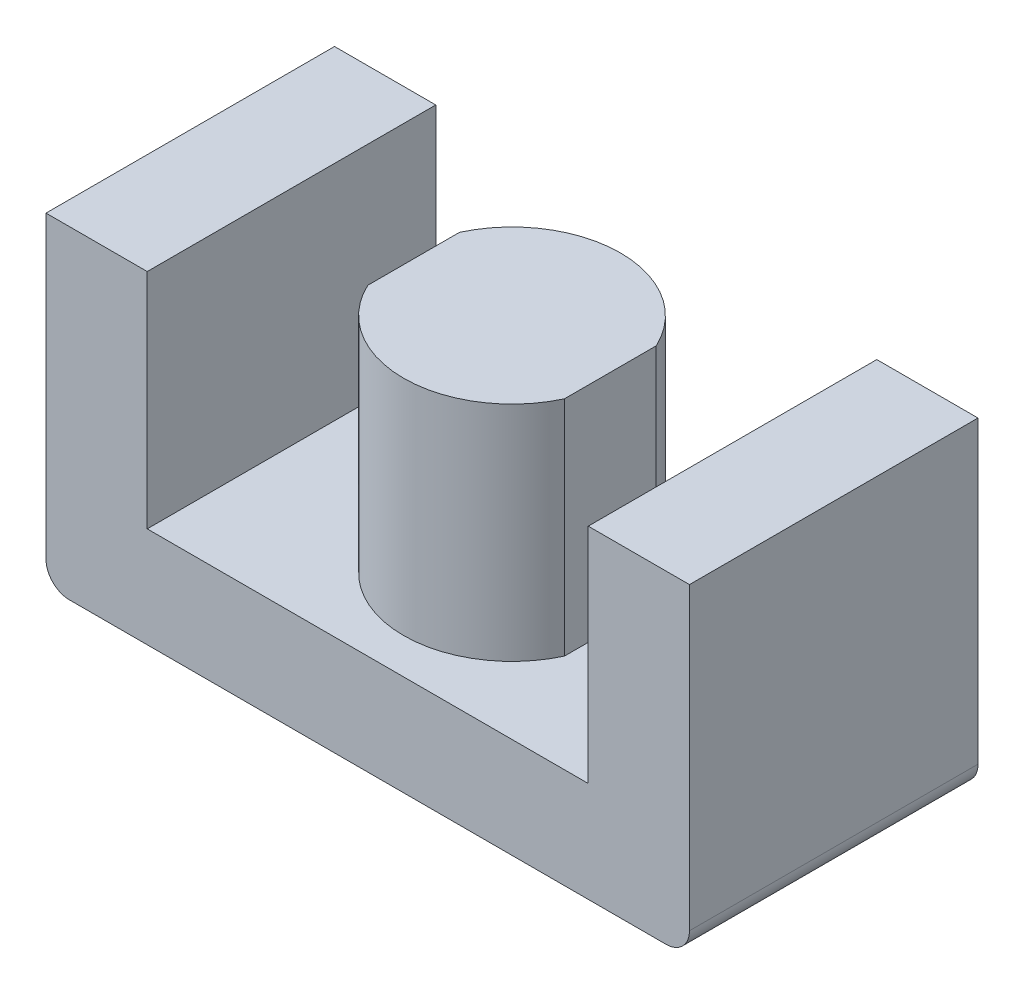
ISO-10303-21;
HEADER;
FILE_DESCRIPTION(('STEP AP214'),'2;1');
FILE_NAME('part.step','',(''),(''),'','','');
FILE_SCHEMA(('AUTOMOTIVE_DESIGN { 1 0 10303 214 1 1 1 1 }'));
ENDSEC;
DATA;
#1=APPLICATION_CONTEXT('core data for automotive mechanical design processes');
#2=APPLICATION_PROTOCOL_DEFINITION('international standard','automotive_design',2000,#1);
#3=PRODUCT_CONTEXT('',#1,'mechanical');
#4=PRODUCT('Part','Part','',(#3));
#5=PRODUCT_RELATED_PRODUCT_CATEGORY('part','',(#4));
#6=PRODUCT_DEFINITION_FORMATION('','',#4);
#7=PRODUCT_DEFINITION_CONTEXT('part definition',#1,'design');
#8=PRODUCT_DEFINITION('design','',#6,#7);
#9=PRODUCT_DEFINITION_SHAPE('','',#8);
#10=(LENGTH_UNIT() NAMED_UNIT(*) SI_UNIT(.MILLI.,.METRE.));
#11=(NAMED_UNIT(*) PLANE_ANGLE_UNIT() SI_UNIT($,.RADIAN.));
#12=(NAMED_UNIT(*) SI_UNIT($,.STERADIAN.) SOLID_ANGLE_UNIT());
#13=UNCERTAINTY_MEASURE_WITH_UNIT(LENGTH_MEASURE(1.E-05),#10,'distance_accuracy_value','');
#14=(GEOMETRIC_REPRESENTATION_CONTEXT(3) GLOBAL_UNCERTAINTY_ASSIGNED_CONTEXT((#13)) GLOBAL_UNIT_ASSIGNED_CONTEXT((#10,
#11,#12)) REPRESENTATION_CONTEXT('',''));
#15=CARTESIAN_POINT('',(0.,0.,0.));
#16=DIRECTION('',(0.,0.,1.));
#17=DIRECTION('',(1.,0.,0.));
#18=AXIS2_PLACEMENT_3D('',#15,#16,#17);
#19=CARTESIAN_POINT('',(0.,27.56,0.));
#20=DIRECTION('',(0.,-1.,0.));
#21=DIRECTION('',(1.,0.,0.));
#22=AXIS2_PLACEMENT_3D('',#19,#20,#21);
#23=CYLINDRICAL_SURFACE('',#22,9.25);
#24=CARTESIAN_POINT('',(0.,27.56,0.));
#25=DIRECTION('',(0.,1.,0.));
#26=DIRECTION('',(-1.,0.,0.));
#27=AXIS2_PLACEMENT_3D('',#24,#25,#26);
#28=CIRCLE('',#27,9.25);
#29=CARTESIAN_POINT('',(8.382,27.56,-3.91210633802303));
#30=VERTEX_POINT('',#29);
#31=CARTESIAN_POINT('',(-8.382,27.56,-3.91210633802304));
#32=VERTEX_POINT('',#31);
#33=EDGE_CURVE('E153',#30,#32,#28,.T.);
#34=ORIENTED_EDGE('',*,*,#33,.F.);
#35=DIRECTION('',(0.,-1.,0.));
#36=VECTOR('',#35,1.);
#37=CARTESIAN_POINT('',(8.382,27.56,-3.91210633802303));
#38=LINE('',#37,#36);
#39=CARTESIAN_POINT('',(8.382,8.56,-3.91210633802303));
#40=VERTEX_POINT('',#39);
#41=EDGE_CURVE('E51',#30,#40,#38,.T.);
#42=ORIENTED_EDGE('',*,*,#41,.T.);
#43=CARTESIAN_POINT('',(0.,8.56,0.));
#44=DIRECTION('',(0.,-1.,0.));
#45=DIRECTION('',(1.,0.,0.));
#46=AXIS2_PLACEMENT_3D('',#43,#44,#45);
#47=CIRCLE('',#46,9.25);
#48=CARTESIAN_POINT('',(-8.38199999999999,8.56,-3.91210633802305));
#49=VERTEX_POINT('',#48);
#50=EDGE_CURVE('E213',#40,#49,#47,.F.);
#51=ORIENTED_EDGE('',*,*,#50,.T.);
#52=DIRECTION('',(0.,-1.,0.));
#53=VECTOR('',#52,1.);
#54=CARTESIAN_POINT('',(-8.382,27.56,-3.91210633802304));
#55=LINE('',#54,#53);
#56=EDGE_CURVE('E235',#49,#32,#55,.F.);
#57=ORIENTED_EDGE('',*,*,#56,.T.);
#58=EDGE_LOOP('',(#34,#42,#51,#57));
#59=FACE_BOUND('',#58,.T.);
#60=ADVANCED_FACE('F37',(#59),#23,.T.);
#61=CARTESIAN_POINT('',(0.,27.56,0.));
#62=DIRECTION('',(0.,1.,0.));
#63=DIRECTION('',(0.,0.,1.));
#64=AXIS2_PLACEMENT_3D('',#61,#62,#63);
#65=PLANE('',#64);
#66=DIRECTION('',(0.,0.,1.));
#67=VECTOR('',#66,1.);
#68=CARTESIAN_POINT('',(-18.8,27.56,-12.3));
#69=LINE('',#68,#67);
#70=CARTESIAN_POINT('',(-18.8,27.56,-12.3));
#71=VERTEX_POINT('',#70);
#72=CARTESIAN_POINT('',(-18.8,27.56,12.3));
#73=VERTEX_POINT('',#72);
#74=EDGE_CURVE('E173',#71,#73,#69,.T.);
#75=ORIENTED_EDGE('',*,*,#74,.F.);
#76=DIRECTION('',(-1.,0.,0.));
#77=VECTOR('',#76,1.);
#78=CARTESIAN_POINT('',(-27.43,27.56,-12.3));
#79=LINE('',#78,#77);
#80=CARTESIAN_POINT('',(-27.43,27.56,-12.3));
#81=VERTEX_POINT('',#80);
#82=EDGE_CURVE('E186',#71,#81,#79,.T.);
#83=ORIENTED_EDGE('',*,*,#82,.T.);
#84=DIRECTION('',(0.,0.,1.));
#85=VECTOR('',#84,1.);
#86=CARTESIAN_POINT('',(-27.43,27.56,-12.3));
#87=LINE('',#86,#85);
#88=CARTESIAN_POINT('',(-27.43,27.56,12.3));
#89=VERTEX_POINT('',#88);
#90=EDGE_CURVE('E191',#81,#89,#87,.T.);
#91=ORIENTED_EDGE('',*,*,#90,.T.);
#92=DIRECTION('',(1.,0.,0.));
#93=VECTOR('',#92,1.);
#94=CARTESIAN_POINT('',(-27.43,27.56,12.3));
#95=LINE('',#94,#93);
#96=EDGE_CURVE('E194',#89,#73,#95,.T.);
#97=ORIENTED_EDGE('',*,*,#96,.T.);
#98=EDGE_LOOP('',(#75,#83,#91,#97));
#99=FACE_BOUND('',#98,.T.);
#100=ADVANCED_FACE('F272',(#99),#65,.T.);
#101=CARTESIAN_POINT('',(27.43,27.56,-12.3));
#102=DIRECTION('',(-1.,0.,0.));
#103=DIRECTION('',(0.,0.,1.));
#104=AXIS2_PLACEMENT_3D('',#101,#102,#103);
#105=PLANE('',#104);
#106=DIRECTION('',(0.,-1.,0.));
#107=VECTOR('',#106,1.);
#108=CARTESIAN_POINT('',(27.43,27.56,12.3));
#109=LINE('',#108,#107);
#110=CARTESIAN_POINT('',(27.43,27.56,12.3));
#111=VERTEX_POINT('',#110);
#112=CARTESIAN_POINT('',(27.43,2.,12.3));
#113=VERTEX_POINT('',#112);
#114=EDGE_CURVE('E197',#111,#113,#109,.T.);
#115=ORIENTED_EDGE('',*,*,#114,.T.);
#116=DIRECTION('',(0.,0.,-1.));
#117=VECTOR('',#116,1.);
#118=CARTESIAN_POINT('',(27.43,2.,-12.3));
#119=LINE('',#118,#117);
#120=CARTESIAN_POINT('',(27.43,2.,-12.3));
#121=VERTEX_POINT('',#120);
#122=EDGE_CURVE('E215',#113,#121,#119,.T.);
#123=ORIENTED_EDGE('',*,*,#122,.T.);
#124=DIRECTION('',(0.,-1.,0.));
#125=VECTOR('',#124,1.);
#126=CARTESIAN_POINT('',(27.43,27.56,-12.3));
#127=LINE('',#126,#125);
#128=CARTESIAN_POINT('',(27.43,27.56,-12.3));
#129=VERTEX_POINT('',#128);
#130=EDGE_CURVE('E210',#129,#121,#127,.T.);
#131=ORIENTED_EDGE('',*,*,#130,.F.);
#132=DIRECTION('',(0.,0.,-1.));
#133=VECTOR('',#132,1.);
#134=CARTESIAN_POINT('',(27.43,27.56,-12.3));
#135=LINE('',#134,#133);
#136=EDGE_CURVE('E183',#111,#129,#135,.T.);
#137=ORIENTED_EDGE('',*,*,#136,.F.);
#138=EDGE_LOOP('',(#115,#123,#131,#137));
#139=FACE_BOUND('',#138,.T.);
#140=ADVANCED_FACE('F292',(#139),#105,.F.);
#141=CARTESIAN_POINT('',(-27.43,27.56,-12.3));
#142=DIRECTION('',(0.,0.,1.));
#143=DIRECTION('',(1.,0.,0.));
#144=AXIS2_PLACEMENT_3D('',#141,#142,#143);
#145=PLANE('',#144);
#146=ORIENTED_EDGE('',*,*,#130,.T.);
#147=CARTESIAN_POINT('',(25.43,2.,-12.3));
#148=DIRECTION('',(0.,0.,1.));
#149=DIRECTION('',(1.,0.,0.));
#150=AXIS2_PLACEMENT_3D('',#147,#148,#149);
#151=CIRCLE('',#150,2.);
#152=CARTESIAN_POINT('',(25.43,0.,-12.3));
#153=VERTEX_POINT('',#152);
#154=EDGE_CURVE('E220',#121,#153,#151,.F.);
#155=ORIENTED_EDGE('',*,*,#154,.T.);
#156=DIRECTION('',(-1.,0.,0.));
#157=VECTOR('',#156,1.);
#158=CARTESIAN_POINT('',(-27.43,0.,-12.3));
#159=LINE('',#158,#157);
#160=CARTESIAN_POINT('',(-25.43,0.,-12.3));
#161=VERTEX_POINT('',#160);
#162=EDGE_CURVE('E175',#153,#161,#159,.T.);
#163=ORIENTED_EDGE('',*,*,#162,.T.);
#164=CARTESIAN_POINT('',(-25.43,2.,-12.3));
#165=DIRECTION('',(0.,0.,1.));
#166=DIRECTION('',(1.,0.,0.));
#167=AXIS2_PLACEMENT_3D('',#164,#165,#166);
#168=CIRCLE('',#167,2.);
#169=CARTESIAN_POINT('',(-27.43,2.,-12.3));
#170=VERTEX_POINT('',#169);
#171=EDGE_CURVE('E218',#161,#170,#168,.F.);
#172=ORIENTED_EDGE('',*,*,#171,.T.);
#173=DIRECTION('',(0.,-1.,0.));
#174=VECTOR('',#173,1.);
#175=CARTESIAN_POINT('',(-27.43,27.56,-12.3));
#176=LINE('',#175,#174);
#177=EDGE_CURVE('E207',#81,#170,#176,.T.);
#178=ORIENTED_EDGE('',*,*,#177,.F.);
#179=ORIENTED_EDGE('',*,*,#82,.F.);
#180=DIRECTION('',(0.,-1.,0.));
#181=VECTOR('',#180,1.);
#182=CARTESIAN_POINT('',(-18.8,27.56,-12.3));
#183=LINE('',#182,#181);
#184=CARTESIAN_POINT('',(-18.8,8.56,-12.3));
#185=VERTEX_POINT('',#184);
#186=EDGE_CURVE('E161',#71,#185,#183,.T.);
#187=ORIENTED_EDGE('',*,*,#186,.T.);
#188=DIRECTION('',(1.,0.,0.));
#189=VECTOR('',#188,1.);
#190=CARTESIAN_POINT('',(-18.8,8.56,-12.3));
#191=LINE('',#190,#189);
#192=CARTESIAN_POINT('',(18.8,8.56000000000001,-12.3));
#193=VERTEX_POINT('',#192);
#194=EDGE_CURVE('E164',#185,#193,#191,.T.);
#195=ORIENTED_EDGE('',*,*,#194,.T.);
#196=DIRECTION('',(0.,1.,0.));
#197=VECTOR('',#196,1.);
#198=CARTESIAN_POINT('',(18.8,27.56,-12.3));
#199=LINE('',#198,#197);
#200=CARTESIAN_POINT('',(18.8,27.56,-12.3));
#201=VERTEX_POINT('',#200);
#202=EDGE_CURVE('E167',#193,#201,#199,.T.);
#203=ORIENTED_EDGE('',*,*,#202,.T.);
#204=EDGE_CURVE('E188',#129,#201,#79,.T.);
#205=ORIENTED_EDGE('',*,*,#204,.F.);
#206=EDGE_LOOP('',(#146,#155,#163,#172,#178,#179,#187,#195,#203,#205));
#207=FACE_BOUND('',#206,.T.);
#208=ADVANCED_FACE('F265',(#207),#145,.F.);
#209=CARTESIAN_POINT('',(-27.43,27.56,-12.3));
#210=DIRECTION('',(1.,0.,0.));
#211=DIRECTION('',(0.,0.,-1.));
#212=AXIS2_PLACEMENT_3D('',#209,#210,#211);
#213=PLANE('',#212);
#214=ORIENTED_EDGE('',*,*,#177,.T.);
#215=DIRECTION('',(0.,0.,1.));
#216=VECTOR('',#215,1.);
#217=CARTESIAN_POINT('',(-27.43,2.,-12.3));
#218=LINE('',#217,#216);
#219=CARTESIAN_POINT('',(-27.43,2.,12.3));
#220=VERTEX_POINT('',#219);
#221=EDGE_CURVE('E230',#170,#220,#218,.T.);
#222=ORIENTED_EDGE('',*,*,#221,.T.);
#223=DIRECTION('',(0.,-1.,0.));
#224=VECTOR('',#223,1.);
#225=CARTESIAN_POINT('',(-27.43,27.56,12.3));
#226=LINE('',#225,#224);
#227=EDGE_CURVE('E204',#89,#220,#226,.T.);
#228=ORIENTED_EDGE('',*,*,#227,.F.);
#229=ORIENTED_EDGE('',*,*,#90,.F.);
#230=EDGE_LOOP('',(#214,#222,#228,#229));
#231=FACE_BOUND('',#230,.T.);
#232=ADVANCED_FACE('F278',(#231),#213,.F.);
#233=CARTESIAN_POINT('',(-27.43,27.56,12.3));
#234=DIRECTION('',(0.,0.,-1.));
#235=DIRECTION('',(-1.,0.,0.));
#236=AXIS2_PLACEMENT_3D('',#233,#234,#235);
#237=PLANE('',#236);
#238=DIRECTION('',(1.,0.,0.));
#239=VECTOR('',#238,1.);
#240=CARTESIAN_POINT('',(-27.43,0.,12.3));
#241=LINE('',#240,#239);
#242=CARTESIAN_POINT('',(-25.43,0.,12.3));
#243=VERTEX_POINT('',#242);
#244=CARTESIAN_POINT('',(25.43,0.,12.3));
#245=VERTEX_POINT('',#244);
#246=EDGE_CURVE('E187',#243,#245,#241,.T.);
#247=ORIENTED_EDGE('',*,*,#246,.T.);
#248=CARTESIAN_POINT('',(25.43,2.,12.3));
#249=DIRECTION('',(0.,0.,-1.));
#250=DIRECTION('',(-1.,0.,0.));
#251=AXIS2_PLACEMENT_3D('',#248,#249,#250);
#252=CIRCLE('',#251,2.);
#253=EDGE_CURVE('E228',#245,#113,#252,.F.);
#254=ORIENTED_EDGE('',*,*,#253,.T.);
#255=ORIENTED_EDGE('',*,*,#114,.F.);
#256=CARTESIAN_POINT('',(18.8,27.56,12.3));
#257=VERTEX_POINT('',#256);
#258=EDGE_CURVE('E193',#257,#111,#95,.T.);
#259=ORIENTED_EDGE('',*,*,#258,.F.);
#260=DIRECTION('',(0.,1.,0.));
#261=VECTOR('',#260,1.);
#262=CARTESIAN_POINT('',(18.8,27.56,12.3));
#263=LINE('',#262,#261);
#264=CARTESIAN_POINT('',(18.8,8.56000000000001,12.3));
#265=VERTEX_POINT('',#264);
#266=EDGE_CURVE('E165',#265,#257,#263,.T.);
#267=ORIENTED_EDGE('',*,*,#266,.F.);
#268=DIRECTION('',(1.,0.,0.));
#269=VECTOR('',#268,1.);
#270=CARTESIAN_POINT('',(-18.8,8.56,12.3));
#271=LINE('',#270,#269);
#272=CARTESIAN_POINT('',(-18.8,8.56,12.3));
#273=VERTEX_POINT('',#272);
#274=EDGE_CURVE('E156',#273,#265,#271,.T.);
#275=ORIENTED_EDGE('',*,*,#274,.F.);
#276=DIRECTION('',(0.,-1.,0.));
#277=VECTOR('',#276,1.);
#278=CARTESIAN_POINT('',(-18.8,27.56,12.3));
#279=LINE('',#278,#277);
#280=EDGE_CURVE('E152',#73,#273,#279,.T.);
#281=ORIENTED_EDGE('',*,*,#280,.F.);
#282=ORIENTED_EDGE('',*,*,#96,.F.);
#283=ORIENTED_EDGE('',*,*,#227,.T.);
#284=CARTESIAN_POINT('',(-25.43,2.,12.3));
#285=DIRECTION('',(0.,0.,-1.));
#286=DIRECTION('',(-1.,0.,0.));
#287=AXIS2_PLACEMENT_3D('',#284,#285,#286);
#288=CIRCLE('',#287,2.);
#289=EDGE_CURVE('E226',#220,#243,#288,.F.);
#290=ORIENTED_EDGE('',*,*,#289,.T.);
#291=EDGE_LOOP('',(#247,#254,#255,#259,#267,#275,#281,#282,#283,#290));
#292=FACE_BOUND('',#291,.T.);
#293=ADVANCED_FACE('F258',(#292),#237,.F.);
#294=DIRECTION('',(0.,0.,1.));
#295=VECTOR('',#294,1.);
#296=CARTESIAN_POINT('',(18.8,27.56,-12.3));
#297=LINE('',#296,#295);
#298=EDGE_CURVE('E176',#201,#257,#297,.T.);
#299=ORIENTED_EDGE('',*,*,#298,.T.);
#300=ORIENTED_EDGE('',*,*,#258,.T.);
#301=ORIENTED_EDGE('',*,*,#136,.T.);
#302=ORIENTED_EDGE('',*,*,#204,.T.);
#303=EDGE_LOOP('',(#299,#300,#301,#302));
#304=FACE_BOUND('',#303,.T.);
#305=ADVANCED_FACE('F262',(#304),#65,.T.);
#306=CARTESIAN_POINT('',(0.,0.,0.));
#307=DIRECTION('',(0.,1.,0.));
#308=DIRECTION('',(0.,0.,1.));
#309=AXIS2_PLACEMENT_3D('',#306,#307,#308);
#310=PLANE('',#309);
#311=ORIENTED_EDGE('',*,*,#162,.F.);
#312=DIRECTION('',(0.,0.,-1.));
#313=VECTOR('',#312,1.);
#314=CARTESIAN_POINT('',(25.43,0.,0.));
#315=LINE('',#314,#313);
#316=EDGE_CURVE('E224',#153,#245,#315,.F.);
#317=ORIENTED_EDGE('',*,*,#316,.T.);
#318=ORIENTED_EDGE('',*,*,#246,.F.);
#319=DIRECTION('',(0.,0.,1.));
#320=VECTOR('',#319,1.);
#321=CARTESIAN_POINT('',(-25.43,0.,0.));
#322=LINE('',#321,#320);
#323=EDGE_CURVE('E222',#243,#161,#322,.F.);
#324=ORIENTED_EDGE('',*,*,#323,.T.);
#325=EDGE_LOOP('',(#311,#317,#318,#324));
#326=FACE_BOUND('',#325,.T.);
#327=ADVANCED_FACE('F285',(#326),#310,.F.);
#328=CARTESIAN_POINT('',(-18.8,27.56,-12.3));
#329=DIRECTION('',(-1.,0.,0.));
#330=DIRECTION('',(0.,-1.,0.));
#331=AXIS2_PLACEMENT_3D('',#328,#329,#330);
#332=PLANE('',#331);
#333=ORIENTED_EDGE('',*,*,#280,.T.);
#334=DIRECTION('',(0.,0.,1.));
#335=VECTOR('',#334,1.);
#336=CARTESIAN_POINT('',(-18.8,8.56,-12.3));
#337=LINE('',#336,#335);
#338=EDGE_CURVE('E169',#185,#273,#337,.T.);
#339=ORIENTED_EDGE('',*,*,#338,.F.);
#340=ORIENTED_EDGE('',*,*,#186,.F.);
#341=ORIENTED_EDGE('',*,*,#74,.T.);
#342=EDGE_LOOP('',(#333,#339,#340,#341));
#343=FACE_BOUND('',#342,.T.);
#344=ADVANCED_FACE('F270',(#343),#332,.F.);
#345=CARTESIAN_POINT('',(18.8,27.56,-12.3));
#346=DIRECTION('',(1.,0.,0.));
#347=DIRECTION('',(0.,1.,0.));
#348=AXIS2_PLACEMENT_3D('',#345,#346,#347);
#349=PLANE('',#348);
#350=ORIENTED_EDGE('',*,*,#266,.T.);
#351=ORIENTED_EDGE('',*,*,#298,.F.);
#352=ORIENTED_EDGE('',*,*,#202,.F.);
#353=DIRECTION('',(0.,0.,1.));
#354=VECTOR('',#353,1.);
#355=CARTESIAN_POINT('',(18.8,8.56000000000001,-12.3));
#356=LINE('',#355,#354);
#357=EDGE_CURVE('E179',#193,#265,#356,.T.);
#358=ORIENTED_EDGE('',*,*,#357,.T.);
#359=EDGE_LOOP('',(#350,#351,#352,#358));
#360=FACE_BOUND('',#359,.T.);
#361=ADVANCED_FACE('F247',(#360),#349,.F.);
#362=CARTESIAN_POINT('',(-18.8,8.56,-12.3));
#363=DIRECTION('',(0.,-1.,0.));
#364=DIRECTION('',(1.,0.,0.));
#365=AXIS2_PLACEMENT_3D('',#362,#363,#364);
#366=PLANE('',#365);
#367=DIRECTION('',(0.,0.,1.));
#368=VECTOR('',#367,1.);
#369=CARTESIAN_POINT('',(8.382,8.56,-15.));
#370=LINE('',#369,#368);
#371=CARTESIAN_POINT('',(8.382,8.56,3.91210633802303));
#372=VERTEX_POINT('',#371);
#373=EDGE_CURVE('E149',#40,#372,#370,.T.);
#374=ORIENTED_EDGE('',*,*,#373,.T.);
#375=CARTESIAN_POINT('',(-8.38199999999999,8.56,3.91210633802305));
#376=VERTEX_POINT('',#375);
#377=EDGE_CURVE('E148',#376,#372,#47,.F.);
#378=ORIENTED_EDGE('',*,*,#377,.F.);
#379=DIRECTION('',(0.,0.,-1.));
#380=VECTOR('',#379,1.);
#381=CARTESIAN_POINT('',(-8.382,8.56,-15.));
#382=LINE('',#381,#380);
#383=EDGE_CURVE('E239',#376,#49,#382,.T.);
#384=ORIENTED_EDGE('',*,*,#383,.T.);
#385=ORIENTED_EDGE('',*,*,#50,.F.);
#386=EDGE_LOOP('',(#374,#378,#384,#385));
#387=FACE_BOUND('',#386,.T.);
#388=ORIENTED_EDGE('',*,*,#274,.T.);
#389=ORIENTED_EDGE('',*,*,#357,.F.);
#390=ORIENTED_EDGE('',*,*,#194,.F.);
#391=ORIENTED_EDGE('',*,*,#338,.T.);
#392=EDGE_LOOP('',(#388,#389,#390,#391));
#393=FACE_BOUND('',#392,.T.);
#394=ADVANCED_FACE('F244',(#387,#393),#366,.F.);
#395=ORIENTED_EDGE('',*,*,#377,.T.);
#396=DIRECTION('',(0.,-1.,0.));
#397=VECTOR('',#396,1.);
#398=CARTESIAN_POINT('',(8.382,27.56,3.91210633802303));
#399=LINE('',#398,#397);
#400=CARTESIAN_POINT('',(8.382,27.56,3.91210633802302));
#401=VERTEX_POINT('',#400);
#402=EDGE_CURVE('E137',#372,#401,#399,.F.);
#403=ORIENTED_EDGE('',*,*,#402,.T.);
#404=CARTESIAN_POINT('',(-8.382,27.56,3.91210633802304));
#405=VERTEX_POINT('',#404);
#406=EDGE_CURVE('E146',#405,#401,#28,.T.);
#407=ORIENTED_EDGE('',*,*,#406,.F.);
#408=DIRECTION('',(0.,-1.,0.));
#409=VECTOR('',#408,1.);
#410=CARTESIAN_POINT('',(-8.382,27.56,3.91210633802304));
#411=LINE('',#410,#409);
#412=EDGE_CURVE('E59',#405,#376,#411,.T.);
#413=ORIENTED_EDGE('',*,*,#412,.T.);
#414=EDGE_LOOP('',(#395,#403,#407,#413));
#415=FACE_BOUND('',#414,.T.);
#416=ADVANCED_FACE('F145',(#415),#23,.T.);
#417=CARTESIAN_POINT('',(0.,27.56,0.));
#418=DIRECTION('',(0.,1.,0.));
#419=DIRECTION('',(-1.,0.,0.));
#420=AXIS2_PLACEMENT_3D('',#417,#418,#419);
#421=PLANE('',#420);
#422=DIRECTION('',(0.,0.,1.));
#423=VECTOR('',#422,1.);
#424=CARTESIAN_POINT('',(8.382,27.56,0.));
#425=LINE('',#424,#423);
#426=EDGE_CURVE('E11',#30,#401,#425,.T.);
#427=ORIENTED_EDGE('',*,*,#426,.F.);
#428=ORIENTED_EDGE('',*,*,#33,.T.);
#429=DIRECTION('',(0.,0.,-1.));
#430=VECTOR('',#429,1.);
#431=CARTESIAN_POINT('',(-8.382,27.56,0.));
#432=LINE('',#431,#430);
#433=EDGE_CURVE('E45',#405,#32,#432,.T.);
#434=ORIENTED_EDGE('',*,*,#433,.F.);
#435=ORIENTED_EDGE('',*,*,#406,.T.);
#436=EDGE_LOOP('',(#427,#428,#434,#435));
#437=FACE_BOUND('',#436,.T.);
#438=ADVANCED_FACE('F151',(#437),#421,.T.);
#439=CARTESIAN_POINT('',(25.43,2.,-12.3));
#440=DIRECTION('',(0.,0.,-1.));
#441=DIRECTION('',(-1.,0.,0.));
#442=AXIS2_PLACEMENT_3D('',#439,#440,#441);
#443=CYLINDRICAL_SURFACE('',#442,2.);
#444=ORIENTED_EDGE('',*,*,#253,.F.);
#445=ORIENTED_EDGE('',*,*,#316,.F.);
#446=ORIENTED_EDGE('',*,*,#154,.F.);
#447=ORIENTED_EDGE('',*,*,#122,.F.);
#448=EDGE_LOOP('',(#444,#445,#446,#447));
#449=FACE_BOUND('',#448,.T.);
#450=ADVANCED_FACE('F290',(#449),#443,.T.);
#451=CARTESIAN_POINT('',(-25.43,2.,-12.3));
#452=DIRECTION('',(0.,0.,1.));
#453=DIRECTION('',(1.,0.,0.));
#454=AXIS2_PLACEMENT_3D('',#451,#452,#453);
#455=CYLINDRICAL_SURFACE('',#454,2.);
#456=ORIENTED_EDGE('',*,*,#171,.F.);
#457=ORIENTED_EDGE('',*,*,#323,.F.);
#458=ORIENTED_EDGE('',*,*,#289,.F.);
#459=ORIENTED_EDGE('',*,*,#221,.F.);
#460=EDGE_LOOP('',(#456,#457,#458,#459));
#461=FACE_BOUND('',#460,.T.);
#462=ADVANCED_FACE('F39',(#461),#455,.T.);
#463=CARTESIAN_POINT('',(-8.382,8.56,-15.));
#464=DIRECTION('',(1.,0.,0.));
#465=DIRECTION('',(0.,0.,-1.));
#466=AXIS2_PLACEMENT_3D('',#463,#464,#465);
#467=PLANE('',#466);
#468=ORIENTED_EDGE('',*,*,#433,.T.);
#469=ORIENTED_EDGE('',*,*,#56,.F.);
#470=ORIENTED_EDGE('',*,*,#383,.F.);
#471=ORIENTED_EDGE('',*,*,#412,.F.);
#472=EDGE_LOOP('',(#468,#469,#470,#471));
#473=FACE_BOUND('',#472,.T.);
#474=ADVANCED_FACE('F234',(#473),#467,.F.);
#475=CARTESIAN_POINT('',(8.382,8.56,-15.));
#476=DIRECTION('',(-1.,0.,0.));
#477=DIRECTION('',(0.,0.,1.));
#478=AXIS2_PLACEMENT_3D('',#475,#476,#477);
#479=PLANE('',#478);
#480=ORIENTED_EDGE('',*,*,#426,.T.);
#481=ORIENTED_EDGE('',*,*,#402,.F.);
#482=ORIENTED_EDGE('',*,*,#373,.F.);
#483=ORIENTED_EDGE('',*,*,#41,.F.);
#484=EDGE_LOOP('',(#480,#481,#482,#483));
#485=FACE_BOUND('',#484,.T.);
#486=ADVANCED_FACE('F136',(#485),#479,.F.);
#487=CLOSED_SHELL('',(#60,#100,#140,#208,#232,#293,#305,#327,#344,#361,#394,#416,#438,#450,#462,
#474,#486));
#488=MANIFOLD_SOLID_BREP('B2',#487);
#489=ADVANCED_BREP_SHAPE_REPRESENTATION('',(#18,#488),#14);
#490=SHAPE_DEFINITION_REPRESENTATION(#9,#489);
ENDSEC;
END-ISO-10303-21;
